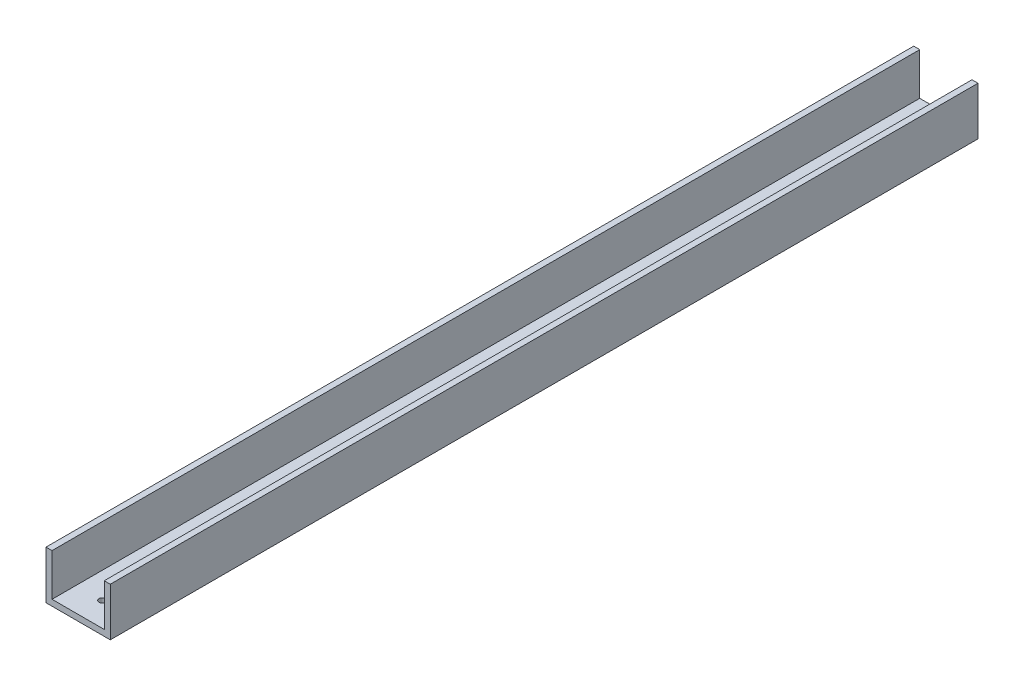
from build123d import *

# Parameters (mm, degrees)
BOSS_EXTRUDE1_DEPTH      = 342.9
BOSS_EXTRUDE1_DEPTH_BACK = 342.9
F_10_CLEARANCE_HOLE2_D   = 5.1054


with BuildPart() as part:
    # Sketch1 → Boss-Extrude1 (new, two sides: drawn at the far end of the back side and taken through both)
    with BuildSketch(Plane.XY.offset(-BOSS_EXTRUDE1_DEPTH_BACK)):
        Polygon((-25.4, 38.1), (-25.4, 0), (25.4, 0), (25.4, 38.1), (20.6375, 38.1), (20.6375, 4.7625), (-20.6375, 4.7625), (-20.6375, 38.1), align=None)
    extrude(amount=BOSS_EXTRUDE1_DEPTH + BOSS_EXTRUDE1_DEPTH_BACK)

    # 10 Clearance Hole2 (through all)
    with Locations(Plane(origin=(0, 0, 323.85), x_dir=(-1, 0, 0), z_dir=(0, -1, 0))):
        with Locations((0, 0), (0, 222.25), (0, 425.45), (0, 647.7)):
            Hole(F_10_CLEARANCE_HOLE2_D / 2)


solid = part.part
